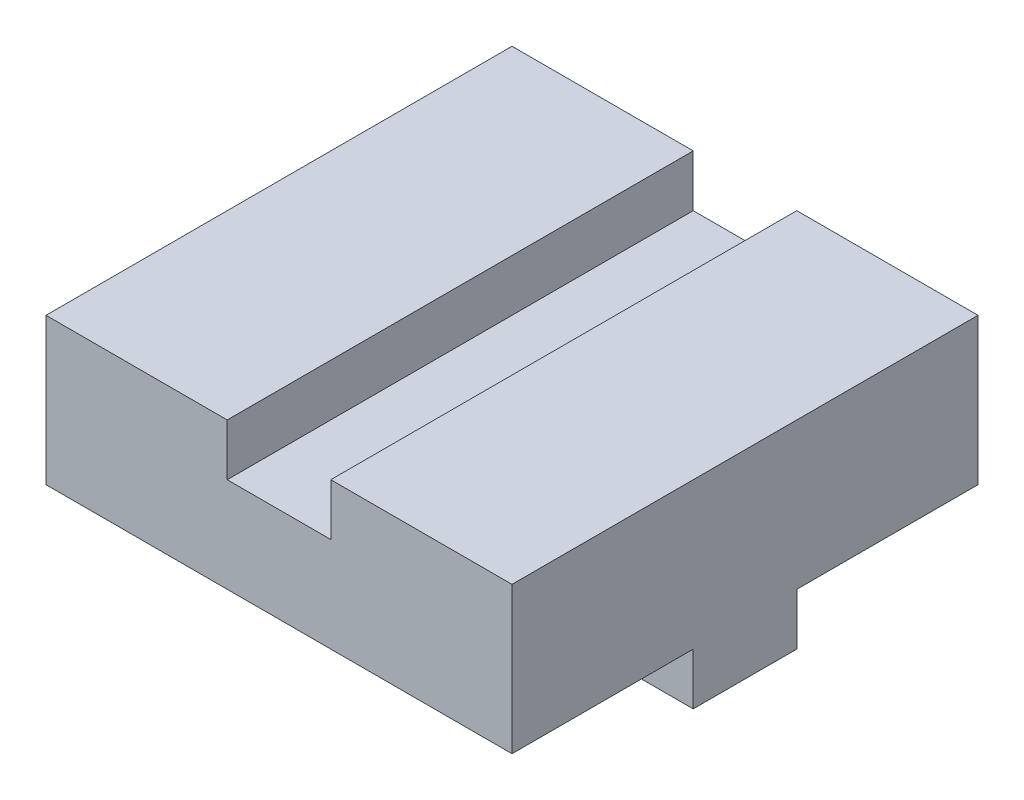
from build123d import *

# Parameters (mm, degrees)
SKETCH1_W           = 90
SKETCH1_H           = 90
BOSS_EXTRUDE1_DEPTH = 28.333333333
SKETCH2_W           = 20
SKETCH2_H           = 10
CUT_EXTRUDE1_DEPTH  = 105.53601187
SKETCH4_W           = 20
SKETCH4_H           = 10
BOSS_EXTRUDE3_DEPTH = 90


with BuildPart() as part:
    # Sketch1 → Boss-Extrude1 (new body)
    with BuildSketch(Plane(origin=(0, 0, 0), x_dir=(1, 0, 0), z_dir=(0, 1, 0))):
        Rectangle(SKETCH1_W, SKETCH1_H)
    extrude(amount=BOSS_EXTRUDE1_DEPTH)

    # Sketch2 → Cut-Extrude1 (cut, through all)
    with BuildSketch(Plane.XY.offset(45)):
        with Locations((0, 23.333333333)):
            Rectangle(SKETCH2_W, SKETCH2_H)
    extrude(amount=-CUT_EXTRUDE1_DEPTH, mode=Mode.SUBTRACT)

    # Sketch4 → Boss-Extrude3 (add)
    with BuildSketch(Plane(origin=(45, 0, 0), x_dir=(0, 0, -1), z_dir=(1, 0, 0))):
        with Locations((0, -5)):
            Rectangle(SKETCH4_W, SKETCH4_H)
    extrude(amount=-BOSS_EXTRUDE3_DEPTH)


solid = part.part
